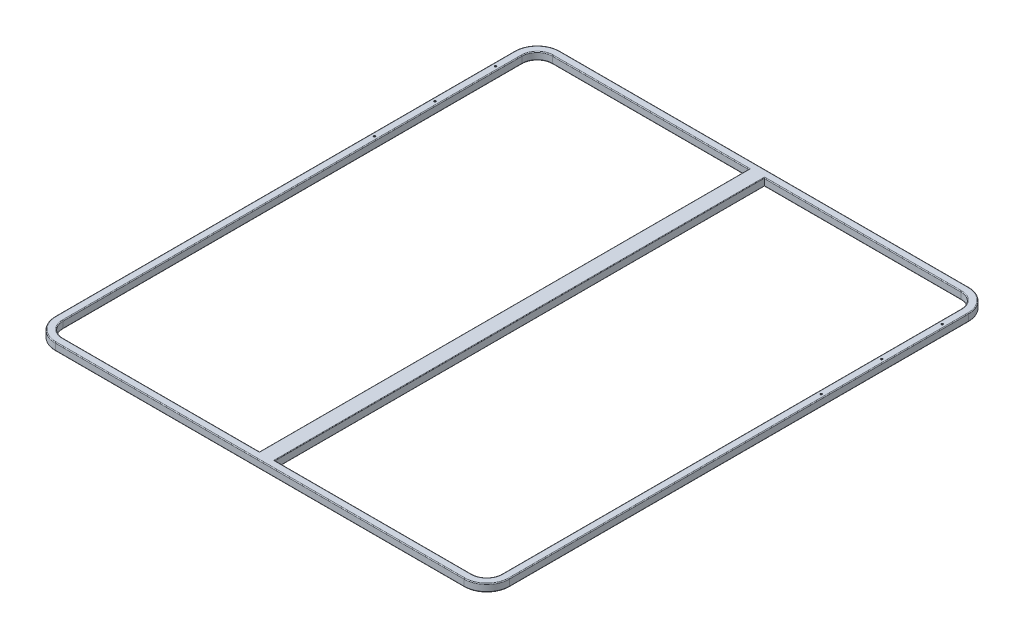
from build123d import *

# Parameters (mm, degrees)
EXTRUDE_1_DEPTH      = 30
SKETCH_2_R           = 3.75
CUT_EXTRUDE_1_DEPTH  = 1346.696845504
FILLET_1_R           = 3
SHELL_2_T            = -2
EXTRUDE_2_DEPTH      = 1943
EXTRUDE_2_DEPTH_BACK = 3
SKETCH_3_W           = 56
SKETCH_3_H           = 26


with BuildPart() as part:
    # Sketch 1 → Extrude 1 (new body)
    with BuildSketch(Plane(origin=(0, 0, 0), x_dir=(1, 0, 0), z_dir=(0, 1, 0))):
        with BuildLine():
            Line((-810, -1000), (810, -1000))
            ThreePointArc((810, -1000), (873.639610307, -973.639610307), (900, -910))
            Line((900, -910), (900, 910))
            ThreePointArc((900, 910), (873.639610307, 973.639610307), (810, 1000))
            Line((810, 1000), (-810, 1000))
            ThreePointArc((-810, 1000), (-873.639610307, 973.639610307), (-900, 910))
            Line((-900, 910), (-900, -910))
            ThreePointArc((-900, -910), (-873.639610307, -973.639610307), (-810, -1000))
        make_face()
        with BuildLine():
            Line((-810, -970), (810, -970))
            ThreePointArc((810, -970), (852.426406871, -952.426406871), (870, -910))
            Line((870, -910), (870, 910))
            ThreePointArc((870, 910), (852.426406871, 952.426406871), (810, 970))
            Line((810, 970), (-810, 970))
            ThreePointArc((-810, 970), (-852.426406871, 952.426406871), (-870, 910))
            Line((-870, 910), (-870, -910))
            ThreePointArc((-870, -910), (-852.426406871, -952.426406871), (-810, -970))
        make_face(mode=Mode.SUBTRACT)
    extrude(amount=EXTRUDE_1_DEPTH)

    # Sketch 2 → Cut-Extrude 1 (cut, through all)
    with BuildSketch(Plane(origin=(0, 30, 0), x_dir=(1, 0, 0), z_dir=(0, 1, 0))):
        with Locations(Location((-885, 820, 0), (0, 0, 270))):
            Circle(SKETCH_2_R)
        with Locations(Location((-885, 580, 0), (0, 0, 270))):
            Circle(SKETCH_2_R)
        with Locations(Location((-885, 340, 0), (0, 0, 270))):
            Circle(SKETCH_2_R)
    cut_extrude_1 = extrude(amount=-CUT_EXTRUDE_1_DEPTH, mode=Mode.SUBTRACT)

    # Mirror 1: Cut-Extrude 1 across plane
    add(cut_extrude_1.mirror(Plane(origin=(0, 0, 0), x_dir=(0, 0, 1), z_dir=(1, 0, 0))), mode=Mode.SUBTRACT)

    # Fillet 1
    fillet_1_edges = [part.edges().sort_by_distance(p)[0] for p in [
        (873.639610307, 30, 973.639610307),
        (0, 0, 1000),
        (-873.639610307, 0, 973.639610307),
        (900, 30, 0),
        (873.639610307, 30, -973.639610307),
        (0, 30, -1000),
        (-873.639610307, 30, -973.639610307),
        (-900, 30, 0),
        (-852.426406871, 0, 952.426406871),
        (0, 0, 970),
        (852.426406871, 0, 952.426406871),
        (870, 0, 0),
        (852.426406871, 0, -952.426406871),
        (0, 0, -970),
        (-852.426406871, 0, -952.426406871),
        (-870, 0, 0),
        (-852.426406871, 30, 952.426406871),
        (0, 30, 970),
        (852.426406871, 30, 952.426406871),
        (870, 30, 0),
        (852.426406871, 30, -952.426406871),
        (0, 30, -970),
        (-852.426406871, 30, -952.426406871),
        (-870, 30, 0),
        (-873.639610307, 30, 973.639610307),
        (0, 30, 1000),
        (-900, 0, 0),
        (-873.639610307, 0, -973.639610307),
        (0, 0, -1000),
        (873.639610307, 0, -973.639610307),
        (900, 0, 0),
        (873.639610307, 0, 973.639610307),
    ]]
    fillet(fillet_1_edges, radius=FILLET_1_R)

    # Shell 2
    shell_2_openings = [part.faces().sort_by_distance(p)[0] for p in [
        (-885, 15, -823.75),
        (-885, 15, -583.75),
        (-885, 15, -343.75),
        (885, 15, -823.75),
        (885, 15, -583.75),
        (885, 15, -343.75),
    ]]
    offset(amount=SHELL_2_T, openings=shell_2_openings, kind=Kind.INTERSECTION)

    # Sketch 3 → Extrude 2 (add, two sides: drawn at the far end of the back side and taken through both)
    with BuildSketch(Plane.XY.offset(-970).offset(-EXTRUDE_2_DEPTH_BACK)):
        with BuildLine():
            Line((-28, 30), (28, 30))
            ThreePointArc((28, 30), (29.414213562, 29.414213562), (30, 28))
            Line((30, 28), (30, 2))
            ThreePointArc((30, 2), (29.414213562, 0.585786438), (28, 0))
            Line((28, 0), (-28, 0))
            ThreePointArc((-28, 0), (-29.414213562, 0.585786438), (-30, 2))
            Line((-30, 2), (-30, 28))
            ThreePointArc((-30, 28), (-29.414213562, 29.414213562), (-28, 30))
        make_face()
        with Locations((0, 15)):
            Rectangle(SKETCH_3_W, SKETCH_3_H, mode=Mode.SUBTRACT)
    extrude(amount=EXTRUDE_2_DEPTH + EXTRUDE_2_DEPTH_BACK)


solid = part.part
